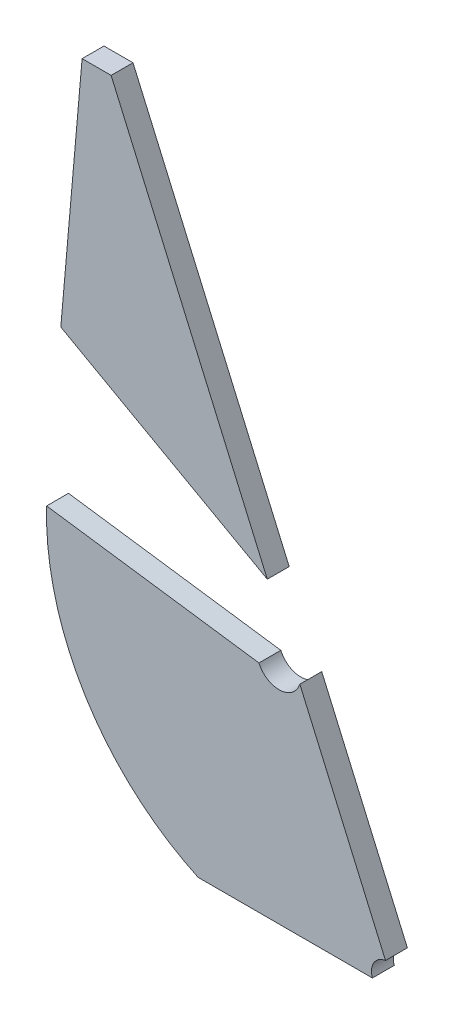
from build123d import *

# Parameters (mm, degrees)
BOSS_EXTRUDE1_DEPTH = 25.4
CUT_EXTRUDE1_DEPTH  = 668.87066792


with BuildPart() as part:
    # Sketch1 → Boss-Extrude1 (new body)
    with BuildSketch(Plane.XY):
        with BuildLine():
            Line((35.464455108, 189.852028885), (241.09486007, -281.793908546))
            ThreePointArc((241.09486007, -281.793908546), (207.063399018, -314.958945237), (254.523604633, -312.594863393))
            Line((254.523604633, -312.594863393), (353.934507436, -540.60953103))
            ThreePointArc((353.934507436, -540.60953103), (340.395207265, -549.62373466), (338.751220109, -565.806003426))
            Line((338.751220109, -565.806003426), (136.419920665, -565.806003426))
            ThreePointArc((136.419920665, -565.806003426), (5.743852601, -449.419420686), (-39.388391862, -280.347980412))
            Line((-39.388391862, -280.347980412), (1.784584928, 189.852028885))
            Line((1.784584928, 189.852028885), (35.464455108, 189.852028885))
        make_face()
    extrude(amount=BOSS_EXTRUDE1_DEPTH)

    # Sketch2 → Cut-Extrude1 (cut, through all)
    with BuildSketch(Plane.XY.offset(25.4)):
        with BuildLine():
            Line((-22.927001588, -92.357058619), (216.754541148, -225.965527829))
            Line((216.754541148, -225.965527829), (241.09486007, -281.793908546))
            ThreePointArc((241.09486007, -281.793908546), (212.619274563, -286.617187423), (207.063399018, -314.958945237))
            Line((207.063399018, -314.958945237), (-39.388391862, -280.347980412))
            Line((-39.388391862, -280.347980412), (-22.927001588, -92.357058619))
        make_face()
    extrude(amount=-CUT_EXTRUDE1_DEPTH, mode=Mode.SUBTRACT)


with BuildPart() as cut_extrude1_piece_1:
    # of the separate pieces the step leaves, piece 1, a body of its own (cut_extrude1_pieces)
    add(part.part.solids().sort_by_distance((136.419920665, -565.806003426, 0))[0])


with BuildPart() as cut_extrude1_piece_2:
    # of the separate pieces the step leaves, piece 2, a body of its own (cut_extrude1_pieces)
    add(part.part.solids().sort_by_distance((-22.927001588, -92.357058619, 0))[0])


solid = Compound([cut_extrude1_piece_1.part, cut_extrude1_piece_2.part])
